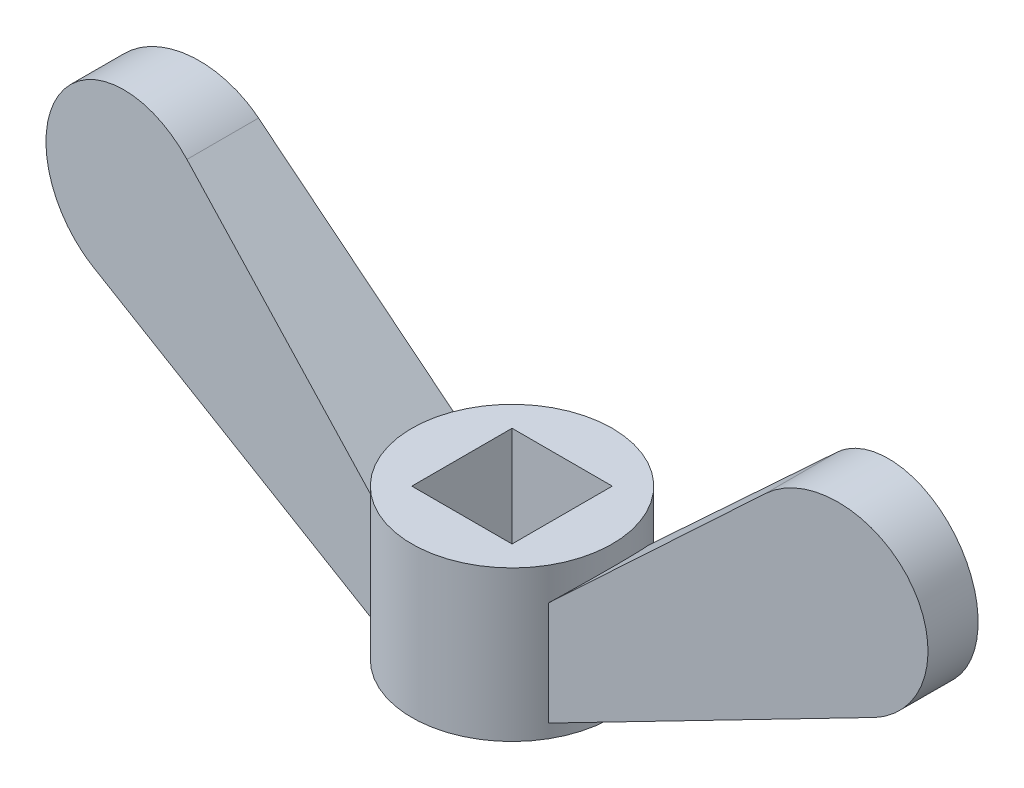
ISO-10303-21;
HEADER;
FILE_DESCRIPTION(('STEP AP214'),'2;1');
FILE_NAME('part.step','',(''),(''),'','','');
FILE_SCHEMA(('AUTOMOTIVE_DESIGN { 1 0 10303 214 1 1 1 1 }'));
ENDSEC;
DATA;
#1=APPLICATION_CONTEXT('core data for automotive mechanical design processes');
#2=APPLICATION_PROTOCOL_DEFINITION('international standard','automotive_design',2000,#1);
#3=PRODUCT_CONTEXT('',#1,'mechanical');
#4=PRODUCT('Part','Part','',(#3));
#5=PRODUCT_RELATED_PRODUCT_CATEGORY('part','',(#4));
#6=PRODUCT_DEFINITION_FORMATION('','',#4);
#7=PRODUCT_DEFINITION_CONTEXT('part definition',#1,'design');
#8=PRODUCT_DEFINITION('design','',#6,#7);
#9=PRODUCT_DEFINITION_SHAPE('','',#8);
#10=(LENGTH_UNIT() NAMED_UNIT(*) SI_UNIT(.MILLI.,.METRE.));
#11=(NAMED_UNIT(*) PLANE_ANGLE_UNIT() SI_UNIT($,.RADIAN.));
#12=(NAMED_UNIT(*) SI_UNIT($,.STERADIAN.) SOLID_ANGLE_UNIT());
#13=UNCERTAINTY_MEASURE_WITH_UNIT(LENGTH_MEASURE(1.E-05),#10,'distance_accuracy_value','');
#14=(GEOMETRIC_REPRESENTATION_CONTEXT(3) GLOBAL_UNCERTAINTY_ASSIGNED_CONTEXT((#13)) GLOBAL_UNIT_ASSIGNED_CONTEXT((#10,
#11,#12)) REPRESENTATION_CONTEXT('',''));
#15=CARTESIAN_POINT('',(0.,0.,0.));
#16=DIRECTION('',(0.,0.,1.));
#17=DIRECTION('',(1.,0.,0.));
#18=AXIS2_PLACEMENT_3D('',#15,#16,#17);
#19=CARTESIAN_POINT('',(35.,24.,5.));
#20=DIRECTION('',(0.,0.,-1.));
#21=DIRECTION('',(-1.,0.,0.));
#22=AXIS2_PLACEMENT_3D('',#19,#20,#21);
#23=CYLINDRICAL_SURFACE('',#22,9.);
#24=DIRECTION('',(0.,0.,1.));
#25=VECTOR('',#24,1.);
#26=CARTESIAN_POINT('',(38.8984336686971,15.8881435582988,5.));
#27=LINE('',#26,#25);
#28=CARTESIAN_POINT('',(38.8984336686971,15.8881435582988,2.86089438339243));
#29=VERTEX_POINT('',#28);
#30=CARTESIAN_POINT('',(38.8984336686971,15.8881435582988,-2.86089438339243));
#31=VERTEX_POINT('',#30);
#32=EDGE_CURVE('E109',#29,#31,#27,.F.);
#33=ORIENTED_EDGE('',*,*,#32,.T.);
#34=CARTESIAN_POINT('',(35.,24.,-3.13667690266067));
#35=DIRECTION('',(-0.0705655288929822,0.,0.997507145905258));
#36=DIRECTION('',(-0.997507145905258,0.,-0.0705655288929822));
#37=AXIS2_PLACEMENT_3D('',#34,#35,#36);
#38=ELLIPSE('',#37,9.02249175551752,9.);
#39=CARTESIAN_POINT('',(28.8633085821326,30.5833895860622,-3.57079797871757));
#40=VERTEX_POINT('',#39);
#41=EDGE_CURVE('E88',#31,#40,#38,.T.);
#42=ORIENTED_EDGE('',*,*,#41,.T.);
#43=DIRECTION('',(0.,0.,1.));
#44=VECTOR('',#43,1.);
#45=CARTESIAN_POINT('',(28.8633085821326,30.5833895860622,5.));
#46=LINE('',#45,#44);
#47=CARTESIAN_POINT('',(28.8633085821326,30.5833895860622,3.57079797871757));
#48=VERTEX_POINT('',#47);
#49=EDGE_CURVE('E84',#40,#48,#46,.T.);
#50=ORIENTED_EDGE('',*,*,#49,.T.);
#51=CARTESIAN_POINT('',(35.,24.,3.13667690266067));
#52=DIRECTION('',(-0.0705655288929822,0.,-0.997507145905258));
#53=DIRECTION('',(0.997507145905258,0.,-0.0705655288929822));
#54=AXIS2_PLACEMENT_3D('',#51,#52,#53);
#55=ELLIPSE('',#54,9.02249175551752,9.);
#56=EDGE_CURVE('E19',#48,#29,#55,.T.);
#57=ORIENTED_EDGE('',*,*,#56,.T.);
#58=EDGE_LOOP('',(#33,#42,#50,#57));
#59=FACE_BOUND('',#58,.T.);
#60=ADVANCED_FACE('F16',(#59),#23,.T.);
#61=CARTESIAN_POINT('',(8.66025403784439,33.,5.));
#62=DIRECTION('',(-0.0705655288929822,0.,-0.997507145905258));
#63=DIRECTION('',(-0.997507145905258,0.,0.0705655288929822));
#64=AXIS2_PLACEMENT_3D('',#61,#62,#63);
#65=PLANE('',#64);
#66=DIRECTION('',(-0.73051032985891,-0.680943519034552,0.0516776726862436));
#67=VECTOR('',#66,1.);
#68=CARTESIAN_POINT('',(28.8633085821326,30.5833895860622,3.57079797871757));
#69=LINE('',#68,#67);
#70=CARTESIAN_POINT('',(8.66025403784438,11.7511588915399,5.));
#71=VERTEX_POINT('',#70);
#72=EDGE_CURVE('E92',#48,#71,#69,.T.);
#73=ORIENTED_EDGE('',*,*,#72,.T.);
#74=DIRECTION('',(0.,-1.,0.));
#75=VECTOR('',#74,1.);
#76=CARTESIAN_POINT('',(8.66025403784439,15.,5.));
#77=LINE('',#76,#75);
#78=CARTESIAN_POINT('',(8.66025403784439,1.35613865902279,5.));
#79=VERTEX_POINT('',#78);
#80=EDGE_CURVE('E137',#79,#71,#77,.F.);
#81=ORIENTED_EDGE('',*,*,#80,.F.);
#82=DIRECTION('',(0.899490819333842,0.432281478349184,-0.0636316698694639));
#83=VECTOR('',#82,1.);
#84=CARTESIAN_POINT('',(8.66025403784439,1.35613865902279,5.));
#85=LINE('',#84,#83);
#86=EDGE_CURVE('E98',#79,#29,#85,.T.);
#87=ORIENTED_EDGE('',*,*,#86,.T.);
#88=ORIENTED_EDGE('',*,*,#56,.F.);
#89=EDGE_LOOP('',(#73,#81,#87,#88));
#90=FACE_BOUND('',#89,.T.);
#91=ADVANCED_FACE('F95',(#90),#65,.F.);
#92=CARTESIAN_POINT('',(5.83840222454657,9.12077623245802,5.));
#93=DIRECTION('',(0.681854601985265,-0.731487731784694,0.));
#94=DIRECTION('',(0.731487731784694,0.681854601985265,0.));
#95=AXIS2_PLACEMENT_3D('',#92,#93,#94);
#96=PLANE('',#95);
#97=ORIENTED_EDGE('',*,*,#72,.F.);
#98=ORIENTED_EDGE('',*,*,#49,.F.);
#99=DIRECTION('',(-0.73051032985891,-0.680943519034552,-0.0516776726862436));
#100=VECTOR('',#99,1.);
#101=CARTESIAN_POINT('',(28.8633085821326,30.5833895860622,-3.57079797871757));
#102=LINE('',#101,#100);
#103=CARTESIAN_POINT('',(8.66025403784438,11.7511588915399,-5.));
#104=VERTEX_POINT('',#103);
#105=EDGE_CURVE('E105',#40,#104,#102,.T.);
#106=ORIENTED_EDGE('',*,*,#105,.T.);
#107=CARTESIAN_POINT('',(0.,3.67852306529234,0.));
#108=DIRECTION('',(0.681854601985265,-0.731487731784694,0.));
#109=DIRECTION('',(-0.731487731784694,-0.681854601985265,0.));
#110=AXIS2_PLACEMENT_3D('',#107,#108,#109);
#111=ELLIPSE('',#110,13.6707692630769,10.);
#112=EDGE_CURVE('E102',#71,#104,#111,.F.);
#113=ORIENTED_EDGE('',*,*,#112,.F.);
#114=EDGE_LOOP('',(#97,#98,#106,#113));
#115=FACE_BOUND('',#114,.T.);
#116=ADVANCED_FACE('F100',(#115),#96,.F.);
#117=CARTESIAN_POINT('',(8.66025403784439,33.,-5.));
#118=DIRECTION('',(-0.0705655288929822,0.,0.997507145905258));
#119=DIRECTION('',(0.997507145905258,0.,0.0705655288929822));
#120=AXIS2_PLACEMENT_3D('',#117,#118,#119);
#121=PLANE('',#120);
#122=ORIENTED_EDGE('',*,*,#105,.F.);
#123=ORIENTED_EDGE('',*,*,#41,.F.);
#124=DIRECTION('',(-0.899490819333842,-0.432281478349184,-0.0636316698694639));
#125=VECTOR('',#124,1.);
#126=CARTESIAN_POINT('',(38.8984336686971,15.8881435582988,-2.86089438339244));
#127=LINE('',#126,#125);
#128=CARTESIAN_POINT('',(8.6602540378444,1.35613865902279,-5.));
#129=VERTEX_POINT('',#128);
#130=EDGE_CURVE('E167',#31,#129,#127,.T.);
#131=ORIENTED_EDGE('',*,*,#130,.T.);
#132=DIRECTION('',(0.,-1.,0.));
#133=VECTOR('',#132,1.);
#134=CARTESIAN_POINT('',(8.66025403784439,15.,-5.));
#135=LINE('',#134,#133);
#136=EDGE_CURVE('E136',#104,#129,#135,.T.);
#137=ORIENTED_EDGE('',*,*,#136,.F.);
#138=EDGE_LOOP('',(#122,#123,#131,#137));
#139=FACE_BOUND('',#138,.T.);
#140=ADVANCED_FACE('F172',(#139),#121,.F.);
#141=CARTESIAN_POINT('',(5.83840222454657,0.,5.));
#142=DIRECTION('',(-0.433159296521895,0.901317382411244,0.));
#143=DIRECTION('',(-0.901317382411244,-0.433159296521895,0.));
#144=AXIS2_PLACEMENT_3D('',#141,#142,#143);
#145=PLANE('',#144);
#146=ORIENTED_EDGE('',*,*,#86,.F.);
#147=CARTESIAN_POINT('',(0.,-2.80584647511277,0.));
#148=DIRECTION('',(-0.433159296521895,0.901317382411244,0.));
#149=DIRECTION('',(-0.901317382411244,-0.433159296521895,0.));
#150=AXIS2_PLACEMENT_3D('',#147,#148,#149);
#151=ELLIPSE('',#150,11.0948709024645,10.);
#152=EDGE_CURVE('E132',#129,#79,#151,.F.);
#153=ORIENTED_EDGE('',*,*,#152,.F.);
#154=ORIENTED_EDGE('',*,*,#130,.F.);
#155=ORIENTED_EDGE('',*,*,#32,.F.);
#156=EDGE_LOOP('',(#146,#153,#154,#155));
#157=FACE_BOUND('',#156,.T.);
#158=ADVANCED_FACE('F175',(#157),#145,.F.);
#159=CARTESIAN_POINT('',(-5.,0.,-5.));
#160=DIRECTION('',(-1.,0.,0.));
#161=DIRECTION('',(0.,0.,1.));
#162=AXIS2_PLACEMENT_3D('',#159,#160,#161);
#163=PLANE('',#162);
#164=DIRECTION('',(0.,1.,0.));
#165=VECTOR('',#164,1.);
#166=CARTESIAN_POINT('',(-5.,0.,5.));
#167=LINE('',#166,#165);
#168=CARTESIAN_POINT('',(-5.,15.,5.));
#169=VERTEX_POINT('',#168);
#170=CARTESIAN_POINT('',(-5.,0.,5.));
#171=VERTEX_POINT('',#170);
#172=EDGE_CURVE('E159',#169,#171,#167,.F.);
#173=ORIENTED_EDGE('',*,*,#172,.T.);
#174=DIRECTION('',(0.,0.,1.));
#175=VECTOR('',#174,1.);
#176=CARTESIAN_POINT('',(-5.,0.,0.));
#177=LINE('',#176,#175);
#178=CARTESIAN_POINT('',(-5.,0.,-5.));
#179=VERTEX_POINT('',#178);
#180=EDGE_CURVE('E135',#171,#179,#177,.F.);
#181=ORIENTED_EDGE('',*,*,#180,.T.);
#182=DIRECTION('',(0.,1.,0.));
#183=VECTOR('',#182,1.);
#184=CARTESIAN_POINT('',(-5.,0.,-5.));
#185=LINE('',#184,#183);
#186=CARTESIAN_POINT('',(-5.,15.,-5.));
#187=VERTEX_POINT('',#186);
#188=EDGE_CURVE('E110',#179,#187,#185,.T.);
#189=ORIENTED_EDGE('',*,*,#188,.T.);
#190=DIRECTION('',(0.,0.,1.));
#191=VECTOR('',#190,1.);
#192=CARTESIAN_POINT('',(-5.,15.,0.));
#193=LINE('',#192,#191);
#194=EDGE_CURVE('E144',#169,#187,#193,.F.);
#195=ORIENTED_EDGE('',*,*,#194,.F.);
#196=EDGE_LOOP('',(#173,#181,#189,#195));
#197=FACE_BOUND('',#196,.T.);
#198=ADVANCED_FACE('F219',(#197),#163,.F.);
#199=CARTESIAN_POINT('',(-5.,0.,-5.));
#200=DIRECTION('',(0.,0.,-1.));
#201=DIRECTION('',(-1.,0.,0.));
#202=AXIS2_PLACEMENT_3D('',#199,#200,#201);
#203=PLANE('',#202);
#204=ORIENTED_EDGE('',*,*,#188,.F.);
#205=DIRECTION('',(1.,0.,0.));
#206=VECTOR('',#205,1.);
#207=CARTESIAN_POINT('',(0.,0.,-5.));
#208=LINE('',#207,#206);
#209=CARTESIAN_POINT('',(5.,0.,-5.));
#210=VERTEX_POINT('',#209);
#211=EDGE_CURVE('E204',#179,#210,#208,.T.);
#212=ORIENTED_EDGE('',*,*,#211,.T.);
#213=DIRECTION('',(0.,1.,0.));
#214=VECTOR('',#213,1.);
#215=CARTESIAN_POINT('',(5.,0.,-5.));
#216=LINE('',#215,#214);
#217=CARTESIAN_POINT('',(5.,15.,-5.));
#218=VERTEX_POINT('',#217);
#219=EDGE_CURVE('E162',#210,#218,#216,.T.);
#220=ORIENTED_EDGE('',*,*,#219,.T.);
#221=DIRECTION('',(1.,0.,0.));
#222=VECTOR('',#221,1.);
#223=CARTESIAN_POINT('',(0.,15.,-5.));
#224=LINE('',#223,#222);
#225=EDGE_CURVE('E141',#187,#218,#224,.T.);
#226=ORIENTED_EDGE('',*,*,#225,.F.);
#227=EDGE_LOOP('',(#204,#212,#220,#226));
#228=FACE_BOUND('',#227,.T.);
#229=ADVANCED_FACE('F221',(#228),#203,.F.);
#230=CARTESIAN_POINT('',(5.,0.,-5.));
#231=DIRECTION('',(1.,0.,0.));
#232=DIRECTION('',(0.,0.,-1.));
#233=AXIS2_PLACEMENT_3D('',#230,#231,#232);
#234=PLANE('',#233);
#235=ORIENTED_EDGE('',*,*,#219,.F.);
#236=DIRECTION('',(0.,0.,1.));
#237=VECTOR('',#236,1.);
#238=CARTESIAN_POINT('',(5.,0.,0.));
#239=LINE('',#238,#237);
#240=CARTESIAN_POINT('',(5.,0.,5.));
#241=VERTEX_POINT('',#240);
#242=EDGE_CURVE('E196',#210,#241,#239,.T.);
#243=ORIENTED_EDGE('',*,*,#242,.T.);
#244=DIRECTION('',(0.,1.,0.));
#245=VECTOR('',#244,1.);
#246=CARTESIAN_POINT('',(5.,0.,5.));
#247=LINE('',#246,#245);
#248=CARTESIAN_POINT('',(5.,15.,5.));
#249=VERTEX_POINT('',#248);
#250=EDGE_CURVE('E156',#241,#249,#247,.T.);
#251=ORIENTED_EDGE('',*,*,#250,.T.);
#252=DIRECTION('',(0.,0.,1.));
#253=VECTOR('',#252,1.);
#254=CARTESIAN_POINT('',(5.,15.,0.));
#255=LINE('',#254,#253);
#256=EDGE_CURVE('E153',#218,#249,#255,.T.);
#257=ORIENTED_EDGE('',*,*,#256,.F.);
#258=EDGE_LOOP('',(#235,#243,#251,#257));
#259=FACE_BOUND('',#258,.T.);
#260=ADVANCED_FACE('F198',(#259),#234,.F.);
#261=CARTESIAN_POINT('',(-5.,0.,5.));
#262=DIRECTION('',(0.,0.,1.));
#263=DIRECTION('',(1.,0.,0.));
#264=AXIS2_PLACEMENT_3D('',#261,#262,#263);
#265=PLANE('',#264);
#266=ORIENTED_EDGE('',*,*,#250,.F.);
#267=DIRECTION('',(1.,0.,0.));
#268=VECTOR('',#267,1.);
#269=CARTESIAN_POINT('',(0.,0.,5.));
#270=LINE('',#269,#268);
#271=EDGE_CURVE('E203',#241,#171,#270,.F.);
#272=ORIENTED_EDGE('',*,*,#271,.T.);
#273=ORIENTED_EDGE('',*,*,#172,.F.);
#274=DIRECTION('',(1.,0.,0.));
#275=VECTOR('',#274,1.);
#276=CARTESIAN_POINT('',(0.,15.,5.));
#277=LINE('',#276,#275);
#278=EDGE_CURVE('E150',#249,#169,#277,.F.);
#279=ORIENTED_EDGE('',*,*,#278,.F.);
#280=EDGE_LOOP('',(#266,#272,#273,#279));
#281=FACE_BOUND('',#280,.T.);
#282=ADVANCED_FACE('F208',(#281),#265,.F.);
#283=CARTESIAN_POINT('',(0.,15.,0.));
#284=DIRECTION('',(0.,1.,0.));
#285=DIRECTION('',(0.,0.,1.));
#286=AXIS2_PLACEMENT_3D('',#283,#284,#285);
#287=PLANE('',#286);
#288=CARTESIAN_POINT('',(0.,15.,0.));
#289=DIRECTION('',(0.,-1.,0.));
#290=DIRECTION('',(0.,0.,-1.));
#291=AXIS2_PLACEMENT_3D('',#288,#289,#290);
#292=CIRCLE('',#291,10.);
#293=CARTESIAN_POINT('',(0.,15.,-10.));
#294=VERTEX_POINT('',#293);
#295=EDGE_CURVE('E128',#294,#294,#292,.T.);
#296=ORIENTED_EDGE('',*,*,#295,.F.);
#297=EDGE_LOOP('',(#296));
#298=FACE_BOUND('',#297,.T.);
#299=ORIENTED_EDGE('',*,*,#194,.T.);
#300=ORIENTED_EDGE('',*,*,#225,.T.);
#301=ORIENTED_EDGE('',*,*,#256,.T.);
#302=ORIENTED_EDGE('',*,*,#278,.T.);
#303=EDGE_LOOP('',(#299,#300,#301,#302));
#304=FACE_BOUND('',#303,.T.);
#305=ADVANCED_FACE('F223',(#298,#304),#287,.T.);
#306=CARTESIAN_POINT('',(0.,0.,0.));
#307=DIRECTION('',(0.,1.,0.));
#308=DIRECTION('',(0.,0.,1.));
#309=AXIS2_PLACEMENT_3D('',#306,#307,#308);
#310=PLANE('',#309);
#311=CARTESIAN_POINT('',(0.,0.,0.));
#312=DIRECTION('',(0.,-1.,0.));
#313=DIRECTION('',(0.,0.,-1.));
#314=AXIS2_PLACEMENT_3D('',#311,#312,#313);
#315=CIRCLE('',#314,10.);
#316=CARTESIAN_POINT('',(0.,0.,-10.));
#317=VERTEX_POINT('',#316);
#318=EDGE_CURVE('E125',#317,#317,#315,.F.);
#319=ORIENTED_EDGE('',*,*,#318,.F.);
#320=EDGE_LOOP('',(#319));
#321=FACE_BOUND('',#320,.T.);
#322=ORIENTED_EDGE('',*,*,#242,.F.);
#323=ORIENTED_EDGE('',*,*,#211,.F.);
#324=ORIENTED_EDGE('',*,*,#180,.F.);
#325=ORIENTED_EDGE('',*,*,#271,.F.);
#326=EDGE_LOOP('',(#322,#323,#324,#325));
#327=FACE_BOUND('',#326,.T.);
#328=ADVANCED_FACE('F210',(#321,#327),#310,.F.);
#329=CARTESIAN_POINT('',(-8.66025403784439,33.,5.));
#330=DIRECTION('',(-0.0705655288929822,0.,0.997507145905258));
#331=DIRECTION('',(0.997507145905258,0.,0.0705655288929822));
#332=AXIS2_PLACEMENT_3D('',#329,#330,#331);
#333=PLANE('',#332);
#334=CARTESIAN_POINT('',(-35.,24.,3.13667690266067));
#335=DIRECTION('',(-0.0705655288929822,0.,0.997507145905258));
#336=DIRECTION('',(-0.997507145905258,0.,-0.0705655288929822));
#337=AXIS2_PLACEMENT_3D('',#334,#335,#336);
#338=ELLIPSE('',#337,9.02249175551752,9.);
#339=CARTESIAN_POINT('',(-38.8984336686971,15.8881435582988,2.86089438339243));
#340=VERTEX_POINT('',#339);
#341=CARTESIAN_POINT('',(-28.8633085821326,30.5833895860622,3.57079797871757));
#342=VERTEX_POINT('',#341);
#343=EDGE_CURVE('E115',#340,#342,#338,.F.);
#344=ORIENTED_EDGE('',*,*,#343,.F.);
#345=DIRECTION('',(-0.899490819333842,0.432281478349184,-0.0636316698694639));
#346=VECTOR('',#345,1.);
#347=CARTESIAN_POINT('',(-8.66025403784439,1.35613865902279,5.));
#348=LINE('',#347,#346);
#349=CARTESIAN_POINT('',(-8.66025403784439,1.35613865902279,5.));
#350=VERTEX_POINT('',#349);
#351=EDGE_CURVE('E117',#350,#340,#348,.T.);
#352=ORIENTED_EDGE('',*,*,#351,.F.);
#353=DIRECTION('',(0.,-1.,0.));
#354=VECTOR('',#353,1.);
#355=CARTESIAN_POINT('',(-8.66025403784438,15.,5.));
#356=LINE('',#355,#354);
#357=CARTESIAN_POINT('',(-8.66025403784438,11.7511588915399,5.));
#358=VERTEX_POINT('',#357);
#359=EDGE_CURVE('E121',#358,#350,#356,.T.);
#360=ORIENTED_EDGE('',*,*,#359,.F.);
#361=DIRECTION('',(0.73051032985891,-0.680943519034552,0.0516776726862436));
#362=VECTOR('',#361,1.);
#363=CARTESIAN_POINT('',(-28.8633085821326,30.5833895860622,3.57079797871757));
#364=LINE('',#363,#362);
#365=EDGE_CURVE('E131',#342,#358,#364,.T.);
#366=ORIENTED_EDGE('',*,*,#365,.F.);
#367=EDGE_LOOP('',(#344,#352,#360,#366));
#368=FACE_BOUND('',#367,.T.);
#369=ADVANCED_FACE('F232',(#368),#333,.T.);
#370=CARTESIAN_POINT('',(-5.83840222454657,9.12077623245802,5.));
#371=DIRECTION('',(0.681854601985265,0.731487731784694,0.));
#372=DIRECTION('',(-0.731487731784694,0.681854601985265,0.));
#373=AXIS2_PLACEMENT_3D('',#370,#371,#372);
#374=PLANE('',#373);
#375=CARTESIAN_POINT('',(0.,3.67852306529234,0.));
#376=DIRECTION('',(0.681854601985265,0.731487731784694,0.));
#377=DIRECTION('',(0.731487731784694,-0.681854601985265,0.));
#378=AXIS2_PLACEMENT_3D('',#375,#376,#377);
#379=ELLIPSE('',#378,13.6707692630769,10.);
#380=CARTESIAN_POINT('',(-8.66025403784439,11.7511588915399,-5.));
#381=VERTEX_POINT('',#380);
#382=EDGE_CURVE('E122',#381,#358,#379,.T.);
#383=ORIENTED_EDGE('',*,*,#382,.F.);
#384=DIRECTION('',(0.73051032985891,-0.680943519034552,-0.0516776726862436));
#385=VECTOR('',#384,1.);
#386=CARTESIAN_POINT('',(-28.8633085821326,30.5833895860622,-3.57079797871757));
#387=LINE('',#386,#385);
#388=CARTESIAN_POINT('',(-28.8633085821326,30.5833895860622,-3.57079797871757));
#389=VERTEX_POINT('',#388);
#390=EDGE_CURVE('E113',#389,#381,#387,.T.);
#391=ORIENTED_EDGE('',*,*,#390,.F.);
#392=DIRECTION('',(0.,0.,1.));
#393=VECTOR('',#392,1.);
#394=CARTESIAN_POINT('',(-28.8633085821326,30.5833895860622,5.));
#395=LINE('',#394,#393);
#396=EDGE_CURVE('E211',#389,#342,#395,.T.);
#397=ORIENTED_EDGE('',*,*,#396,.T.);
#398=ORIENTED_EDGE('',*,*,#365,.T.);
#399=EDGE_LOOP('',(#383,#391,#397,#398));
#400=FACE_BOUND('',#399,.T.);
#401=ADVANCED_FACE('F253',(#400),#374,.T.);
#402=CARTESIAN_POINT('',(0.,15.,0.));
#403=DIRECTION('',(0.,-1.,0.));
#404=DIRECTION('',(0.,0.,-1.));
#405=AXIS2_PLACEMENT_3D('',#402,#403,#404);
#406=CYLINDRICAL_SURFACE('',#405,10.);
#407=ORIENTED_EDGE('',*,*,#295,.T.);
#408=EDGE_LOOP('',(#407));
#409=FACE_BOUND('',#408,.T.);
#410=CARTESIAN_POINT('',(0.,-2.80584647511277,0.));
#411=DIRECTION('',(-0.433159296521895,-0.901317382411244,0.));
#412=DIRECTION('',(0.901317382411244,-0.433159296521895,0.));
#413=AXIS2_PLACEMENT_3D('',#410,#411,#412);
#414=ELLIPSE('',#413,11.0948709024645,10.);
#415=CARTESIAN_POINT('',(-8.66025403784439,1.35613865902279,-5.));
#416=VERTEX_POINT('',#415);
#417=EDGE_CURVE('E118',#416,#350,#414,.F.);
#418=ORIENTED_EDGE('',*,*,#417,.F.);
#419=DIRECTION('',(0.,1.,0.));
#420=VECTOR('',#419,1.);
#421=CARTESIAN_POINT('',(-8.66025403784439,33.,-5.));
#422=LINE('',#421,#420);
#423=EDGE_CURVE('E25',#381,#416,#422,.F.);
#424=ORIENTED_EDGE('',*,*,#423,.F.);
#425=ORIENTED_EDGE('',*,*,#382,.T.);
#426=ORIENTED_EDGE('',*,*,#359,.T.);
#427=EDGE_LOOP('',(#418,#424,#425,#426));
#428=FACE_BOUND('',#427,.T.);
#429=ORIENTED_EDGE('',*,*,#318,.T.);
#430=EDGE_LOOP('',(#429));
#431=FACE_BOUND('',#430,.T.);
#432=ORIENTED_EDGE('',*,*,#136,.T.);
#433=ORIENTED_EDGE('',*,*,#152,.T.);
#434=ORIENTED_EDGE('',*,*,#80,.T.);
#435=ORIENTED_EDGE('',*,*,#112,.T.);
#436=EDGE_LOOP('',(#432,#433,#434,#435));
#437=FACE_BOUND('',#436,.T.);
#438=ADVANCED_FACE('F173',(#409,#428,#431,#437),#406,.T.);
#439=CARTESIAN_POINT('',(-5.83840222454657,0.,5.));
#440=DIRECTION('',(-0.433159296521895,-0.901317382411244,0.));
#441=DIRECTION('',(0.901317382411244,-0.433159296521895,0.));
#442=AXIS2_PLACEMENT_3D('',#439,#440,#441);
#443=PLANE('',#442);
#444=DIRECTION('',(0.,0.,-1.));
#445=VECTOR('',#444,1.);
#446=CARTESIAN_POINT('',(-38.8984336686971,15.8881435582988,5.));
#447=LINE('',#446,#445);
#448=CARTESIAN_POINT('',(-38.8984336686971,15.8881435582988,-2.86089438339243));
#449=VERTEX_POINT('',#448);
#450=EDGE_CURVE('E114',#449,#340,#447,.F.);
#451=ORIENTED_EDGE('',*,*,#450,.F.);
#452=DIRECTION('',(-0.899490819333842,0.432281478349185,0.0636316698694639));
#453=VECTOR('',#452,1.);
#454=CARTESIAN_POINT('',(-8.66025403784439,1.35613865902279,-5.));
#455=LINE('',#454,#453);
#456=EDGE_CURVE('E11',#416,#449,#455,.T.);
#457=ORIENTED_EDGE('',*,*,#456,.F.);
#458=ORIENTED_EDGE('',*,*,#417,.T.);
#459=ORIENTED_EDGE('',*,*,#351,.T.);
#460=EDGE_LOOP('',(#451,#457,#458,#459));
#461=FACE_BOUND('',#460,.T.);
#462=ADVANCED_FACE('F245',(#461),#443,.T.);
#463=CARTESIAN_POINT('',(-35.,24.,5.));
#464=DIRECTION('',(0.,0.,-1.));
#465=DIRECTION('',(-1.,0.,0.));
#466=AXIS2_PLACEMENT_3D('',#463,#464,#465);
#467=CYLINDRICAL_SURFACE('',#466,9.);
#468=CARTESIAN_POINT('',(-35.,24.,-3.13667690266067));
#469=DIRECTION('',(-0.0705655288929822,0.,-0.997507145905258));
#470=DIRECTION('',(0.997507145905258,0.,-0.0705655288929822));
#471=AXIS2_PLACEMENT_3D('',#468,#469,#470);
#472=ELLIPSE('',#471,9.02249175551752,9.);
#473=EDGE_CURVE('E34',#449,#389,#472,.T.);
#474=ORIENTED_EDGE('',*,*,#473,.F.);
#475=ORIENTED_EDGE('',*,*,#450,.T.);
#476=ORIENTED_EDGE('',*,*,#343,.T.);
#477=ORIENTED_EDGE('',*,*,#396,.F.);
#478=EDGE_LOOP('',(#474,#475,#476,#477));
#479=FACE_BOUND('',#478,.T.);
#480=ADVANCED_FACE('F239',(#479),#467,.T.);
#481=CARTESIAN_POINT('',(-8.66025403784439,33.,-5.));
#482=DIRECTION('',(-0.0705655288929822,0.,-0.997507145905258));
#483=DIRECTION('',(-0.997507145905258,0.,0.0705655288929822));
#484=AXIS2_PLACEMENT_3D('',#481,#482,#483);
#485=PLANE('',#484);
#486=ORIENTED_EDGE('',*,*,#456,.T.);
#487=ORIENTED_EDGE('',*,*,#473,.T.);
#488=ORIENTED_EDGE('',*,*,#390,.T.);
#489=ORIENTED_EDGE('',*,*,#423,.T.);
#490=EDGE_LOOP('',(#486,#487,#488,#489));
#491=FACE_BOUND('',#490,.T.);
#492=ADVANCED_FACE('F237',(#491),#485,.T.);
#493=CLOSED_SHELL('',(#60,#91,#116,#140,#158,#198,#229,#260,#282,#305,#328,#369,#401,#438,#462,
#480,#492));
#494=MANIFOLD_SOLID_BREP('B1',#493);
#495=ADVANCED_BREP_SHAPE_REPRESENTATION('',(#18,#494),#14);
#496=SHAPE_DEFINITION_REPRESENTATION(#9,#495);
ENDSEC;
END-ISO-10303-21;
